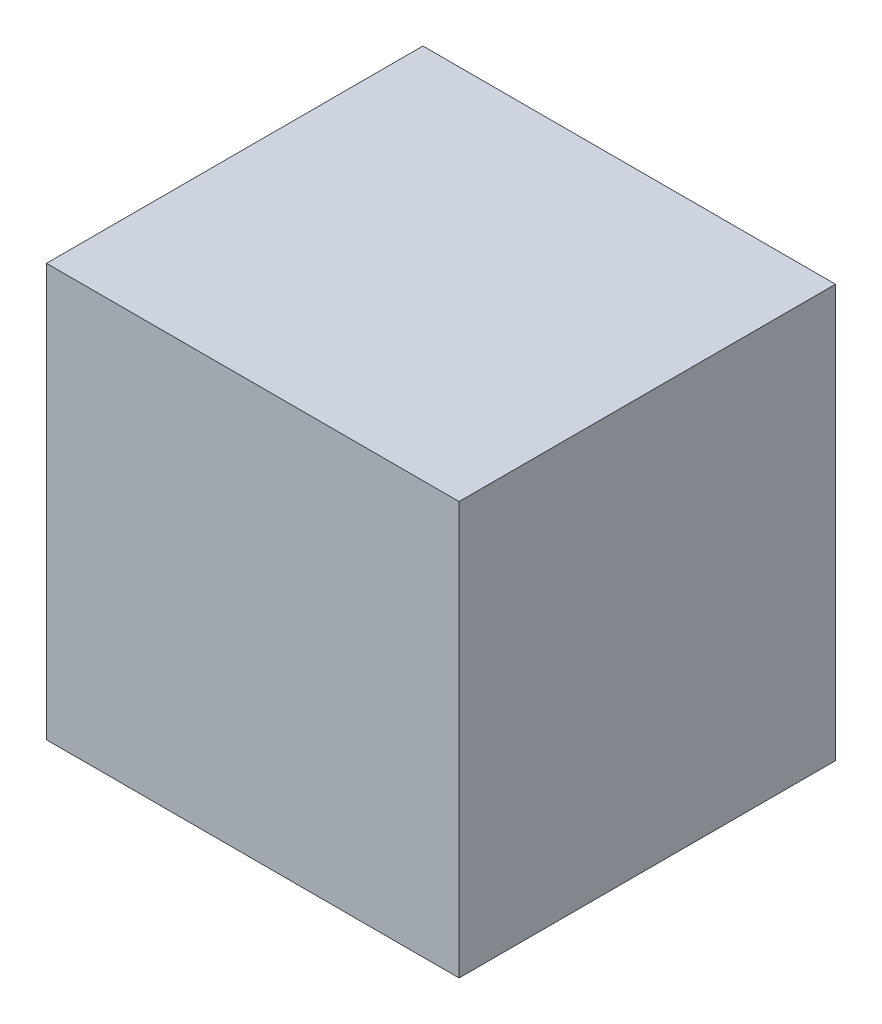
from build123d import *

# Parameters (mm, degrees)
SKETCH1_W           = 57
SKETCH1_H           = 57
BOSS_EXTRUDE1_DEPTH = 26


with BuildPart() as part:
    # Sketch1 → Boss-Extrude1 (new, symmetric)
    with BuildSketch(Plane.XY):
        Rectangle(SKETCH1_W, SKETCH1_H)
    extrude(amount=BOSS_EXTRUDE1_DEPTH, both=True)


solid = part.part
